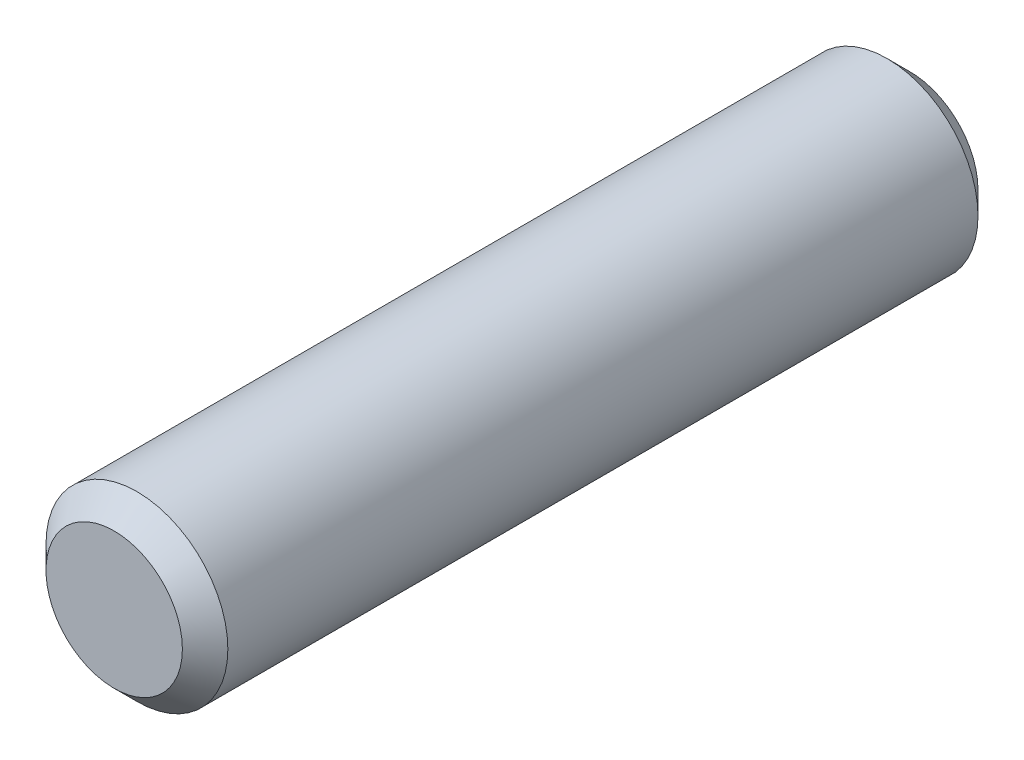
from build123d import *

# Parameters (mm, degrees)
ESQUISSE1_R          = 4
BASE_EXTRUSION_DEPTH = 35
CHANFREIN1_SIZE      = 1


with BuildPart() as part:
    # Esquisse1 → Base-Extrusion (new body)
    with BuildSketch(Plane.XY):
        Circle(ESQUISSE1_R)
    extrude(amount=BASE_EXTRUSION_DEPTH)

    # Chanfrein1
    chanfrein1_edges = [part.edges().sort_by_distance(p)[0] for p in [
        (-4, 0, 0),
        (-4, 0, 35),
    ]]
    chamfer(chanfrein1_edges, length=CHANFREIN1_SIZE)


solid = part.part
